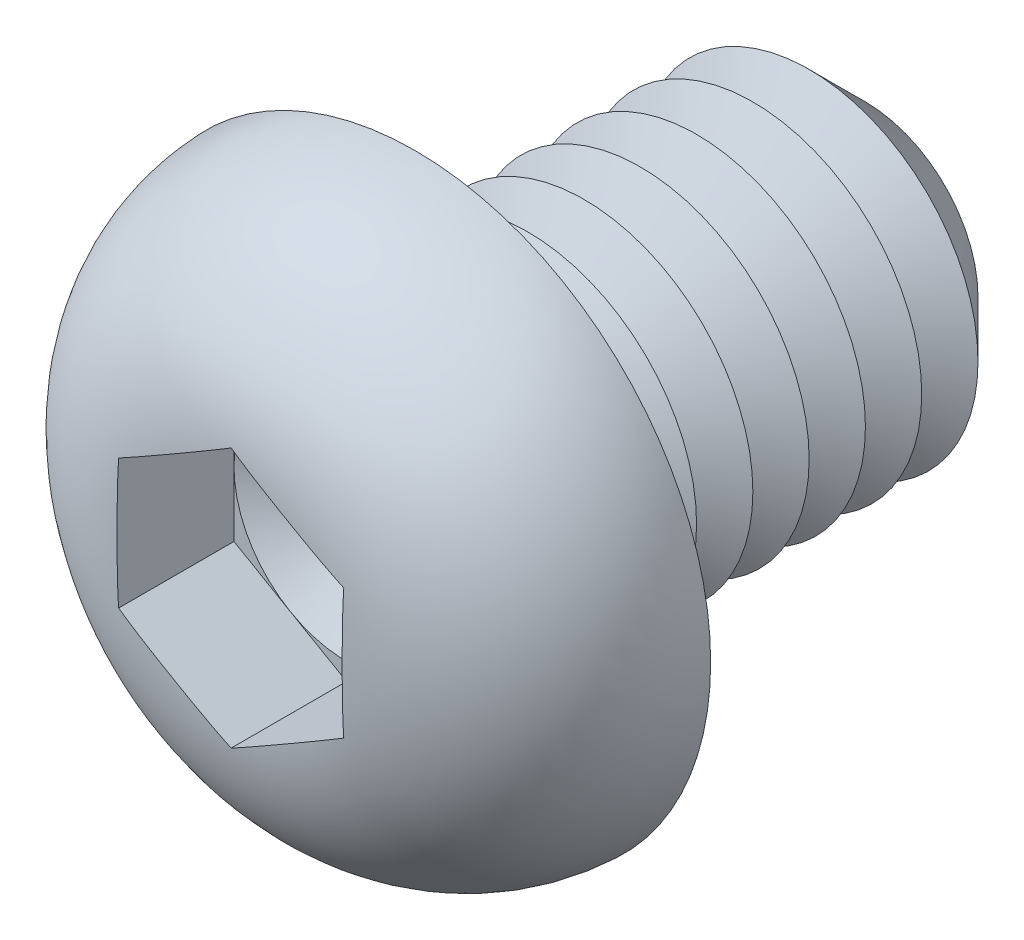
ISO-10303-21;
HEADER;
FILE_DESCRIPTION(('STEP AP214'),'2;1');
FILE_NAME('part.step','',(''),(''),'','','');
FILE_SCHEMA(('AUTOMOTIVE_DESIGN { 1 0 10303 214 1 1 1 1 }'));
ENDSEC;
DATA;
#1=APPLICATION_CONTEXT('core data for automotive mechanical design processes');
#2=APPLICATION_PROTOCOL_DEFINITION('international standard','automotive_design',2000,#1);
#3=PRODUCT_CONTEXT('',#1,'mechanical');
#4=PRODUCT('Part','Part','',(#3));
#5=PRODUCT_RELATED_PRODUCT_CATEGORY('part','',(#4));
#6=PRODUCT_DEFINITION_FORMATION('','',#4);
#7=PRODUCT_DEFINITION_CONTEXT('part definition',#1,'design');
#8=PRODUCT_DEFINITION('design','',#6,#7);
#9=PRODUCT_DEFINITION_SHAPE('','',#8);
#10=(LENGTH_UNIT() NAMED_UNIT(*) SI_UNIT(.MILLI.,.METRE.));
#11=(NAMED_UNIT(*) PLANE_ANGLE_UNIT() SI_UNIT($,.RADIAN.));
#12=(NAMED_UNIT(*) SI_UNIT($,.STERADIAN.) SOLID_ANGLE_UNIT());
#13=UNCERTAINTY_MEASURE_WITH_UNIT(LENGTH_MEASURE(1.E-05),#10,'distance_accuracy_value','');
#14=(GEOMETRIC_REPRESENTATION_CONTEXT(3) GLOBAL_UNCERTAINTY_ASSIGNED_CONTEXT((#13)) GLOBAL_UNIT_ASSIGNED_CONTEXT((#10,
#11,#12)) REPRESENTATION_CONTEXT('',''));
#15=CARTESIAN_POINT('',(0.,0.,0.));
#16=DIRECTION('',(0.,0.,1.));
#17=DIRECTION('',(1.,0.,0.));
#18=AXIS2_PLACEMENT_3D('',#15,#16,#17);
#19=CARTESIAN_POINT('',(0.,0.,1.22));
#20=DIRECTION('',(0.,0.,1.));
#21=DIRECTION('',(1.,0.,0.));
#22=AXIS2_PLACEMENT_3D('',#19,#20,#21);
#23=PLANE('',#22);
#24=CARTESIAN_POINT('',(0.,0.,1.22));
#25=DIRECTION('',(0.,0.,1.));
#26=DIRECTION('',(1.,0.,0.));
#27=AXIS2_PLACEMENT_3D('',#24,#25,#26);
#28=CIRCLE('',#27,2.);
#29=CARTESIAN_POINT('',(2.,0.,1.22));
#30=VERTEX_POINT('',#29);
#31=CARTESIAN_POINT('',(1.,1.73205080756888,1.22));
#32=VERTEX_POINT('',#31);
#33=EDGE_CURVE('E117',#30,#32,#28,.T.);
#34=ORIENTED_EDGE('',*,*,#33,.F.);
#35=DIRECTION('',(0.,1.,0.));
#36=VECTOR('',#35,1.);
#37=CARTESIAN_POINT('',(2.,-1.15470053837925,1.22));
#38=LINE('',#37,#36);
#39=CARTESIAN_POINT('',(2.,1.15470053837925,1.22));
#40=VERTEX_POINT('',#39);
#41=EDGE_CURVE('E140',#30,#40,#38,.T.);
#42=ORIENTED_EDGE('',*,*,#41,.T.);
#43=DIRECTION('',(-0.866025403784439,0.5,0.));
#44=VECTOR('',#43,1.);
#45=CARTESIAN_POINT('',(2.,1.15470053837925,1.22));
#46=LINE('',#45,#44);
#47=EDGE_CURVE('E136',#40,#32,#46,.T.);
#48=ORIENTED_EDGE('',*,*,#47,.T.);
#49=EDGE_LOOP('',(#34,#42,#48));
#50=FACE_BOUND('',#49,.T.);
#51=ADVANCED_FACE('F39',(#50),#23,.T.);
#52=CARTESIAN_POINT('',(0.,0.,1.22));
#53=DIRECTION('',(0.,0.,1.));
#54=DIRECTION('',(1.,0.,0.));
#55=AXIS2_PLACEMENT_3D('',#52,#53,#54);
#56=CIRCLE('',#55,2.);
#57=CARTESIAN_POINT('',(-1.,1.73205080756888,1.22));
#58=VERTEX_POINT('',#57);
#59=EDGE_CURVE('E11',#32,#58,#56,.T.);
#60=ORIENTED_EDGE('',*,*,#59,.F.);
#61=CARTESIAN_POINT('',(0.,2.3094010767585,1.22));
#62=VERTEX_POINT('',#61);
#63=EDGE_CURVE('E130',#32,#62,#46,.T.);
#64=ORIENTED_EDGE('',*,*,#63,.T.);
#65=DIRECTION('',(-0.866025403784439,-0.5,0.));
#66=VECTOR('',#65,1.);
#67=CARTESIAN_POINT('',(0.,2.3094010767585,1.22));
#68=LINE('',#67,#66);
#69=EDGE_CURVE('E131',#62,#58,#68,.T.);
#70=ORIENTED_EDGE('',*,*,#69,.T.);
#71=EDGE_LOOP('',(#60,#64,#70));
#72=FACE_BOUND('',#71,.T.);
#73=ADVANCED_FACE('F129',(#72),#23,.T.);
#74=CARTESIAN_POINT('',(-2.,0.,1.22));
#75=VERTEX_POINT('',#74);
#76=EDGE_CURVE('E49',#58,#75,#56,.T.);
#77=ORIENTED_EDGE('',*,*,#76,.F.);
#78=CARTESIAN_POINT('',(-2.,1.15470053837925,1.22));
#79=VERTEX_POINT('',#78);
#80=EDGE_CURVE('E143',#58,#79,#68,.T.);
#81=ORIENTED_EDGE('',*,*,#80,.T.);
#82=DIRECTION('',(0.,-1.,0.));
#83=VECTOR('',#82,1.);
#84=CARTESIAN_POINT('',(-2.,1.15470053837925,1.22));
#85=LINE('',#84,#83);
#86=EDGE_CURVE('E153',#79,#75,#85,.T.);
#87=ORIENTED_EDGE('',*,*,#86,.T.);
#88=EDGE_LOOP('',(#77,#81,#87));
#89=FACE_BOUND('',#88,.T.);
#90=ADVANCED_FACE('F267',(#89),#23,.T.);
#91=CARTESIAN_POINT('',(-1.,-1.73205080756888,1.22));
#92=VERTEX_POINT('',#91);
#93=EDGE_CURVE('E253',#75,#92,#56,.T.);
#94=ORIENTED_EDGE('',*,*,#93,.F.);
#95=CARTESIAN_POINT('',(-2.,-1.15470053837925,1.22));
#96=VERTEX_POINT('',#95);
#97=EDGE_CURVE('E152',#75,#96,#85,.T.);
#98=ORIENTED_EDGE('',*,*,#97,.T.);
#99=DIRECTION('',(0.866025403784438,-0.5,0.));
#100=VECTOR('',#99,1.);
#101=CARTESIAN_POINT('',(-2.,-1.15470053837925,1.22));
#102=LINE('',#101,#100);
#103=EDGE_CURVE('E158',#96,#92,#102,.T.);
#104=ORIENTED_EDGE('',*,*,#103,.T.);
#105=EDGE_LOOP('',(#94,#98,#104));
#106=FACE_BOUND('',#105,.T.);
#107=ADVANCED_FACE('F261',(#106),#23,.T.);
#108=CARTESIAN_POINT('',(0.999999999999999,-1.73205080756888,1.22));
#109=VERTEX_POINT('',#108);
#110=EDGE_CURVE('E56',#92,#109,#56,.T.);
#111=ORIENTED_EDGE('',*,*,#110,.F.);
#112=CARTESIAN_POINT('',(0.,-2.3094010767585,1.22));
#113=VERTEX_POINT('',#112);
#114=EDGE_CURVE('E157',#92,#113,#102,.T.);
#115=ORIENTED_EDGE('',*,*,#114,.T.);
#116=DIRECTION('',(0.866025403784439,0.5,0.));
#117=VECTOR('',#116,1.);
#118=CARTESIAN_POINT('',(0.,-2.3094010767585,1.22));
#119=LINE('',#118,#117);
#120=EDGE_CURVE('E163',#113,#109,#119,.T.);
#121=ORIENTED_EDGE('',*,*,#120,.T.);
#122=EDGE_LOOP('',(#111,#115,#121));
#123=FACE_BOUND('',#122,.T.);
#124=ADVANCED_FACE('F303',(#123),#23,.T.);
#125=CARTESIAN_POINT('',(0.,0.,-8.));
#126=DIRECTION('',(0.,0.,1.));
#127=DIRECTION('',(1.,0.,0.));
#128=AXIS2_PLACEMENT_3D('',#125,#126,#127);
#129=CYLINDRICAL_SURFACE('',#128,3.);
#130=CARTESIAN_POINT('',(0.,0.,-0.5));
#131=DIRECTION('',(0.,0.,1.));
#132=DIRECTION('',(1.,0.,0.));
#133=AXIS2_PLACEMENT_3D('',#130,#131,#132);
#134=CIRCLE('',#133,3.);
#135=CARTESIAN_POINT('',(3.,0.,-0.5));
#136=VERTEX_POINT('',#135);
#137=EDGE_CURVE('E241',#136,#136,#134,.F.);
#138=ORIENTED_EDGE('',*,*,#137,.T.);
#139=EDGE_LOOP('',(#138));
#140=FACE_BOUND('',#139,.T.);
#141=CARTESIAN_POINT('',(0.,0.,-1.));
#142=DIRECTION('',(0.,0.,1.));
#143=DIRECTION('',(1.,0.,0.));
#144=AXIS2_PLACEMENT_3D('',#141,#142,#143);
#145=CIRCLE('',#144,3.00000000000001);
#146=CARTESIAN_POINT('',(3.00000000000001,0.,-1.));
#147=VERTEX_POINT('',#146);
#148=EDGE_CURVE('E138',#147,#147,#145,.T.);
#149=ORIENTED_EDGE('',*,*,#148,.T.);
#150=EDGE_LOOP('',(#149));
#151=FACE_BOUND('',#150,.T.);
#152=ADVANCED_FACE('F304',(#140,#151),#129,.T.);
#153=CARTESIAN_POINT('',(0.,5.25,0.));
#154=DIRECTION('',(0.,0.,1.));
#155=DIRECTION('',(1.,0.,0.));
#156=AXIS2_PLACEMENT_3D('',#153,#154,#155);
#157=PLANE('',#156);
#158=CARTESIAN_POINT('',(0.,0.,0.));
#159=DIRECTION('',(0.,0.,1.));
#160=DIRECTION('',(1.,0.,0.));
#161=AXIS2_PLACEMENT_3D('',#158,#159,#160);
#162=CIRCLE('',#161,3.5);
#163=CARTESIAN_POINT('',(3.5,0.,0.));
#164=VERTEX_POINT('',#163);
#165=EDGE_CURVE('E244',#164,#164,#162,.T.);
#166=ORIENTED_EDGE('',*,*,#165,.T.);
#167=EDGE_LOOP('',(#166));
#168=FACE_BOUND('',#167,.T.);
#169=CARTESIAN_POINT('',(0.,0.,0.));
#170=DIRECTION('',(0.,0.,1.));
#171=DIRECTION('',(1.,0.,0.));
#172=AXIS2_PLACEMENT_3D('',#169,#170,#171);
#173=CIRCLE('',#172,5.25);
#174=CARTESIAN_POINT('',(5.25,0.,0.));
#175=VERTEX_POINT('',#174);
#176=EDGE_CURVE('E174',#175,#175,#173,.T.);
#177=ORIENTED_EDGE('',*,*,#176,.F.);
#178=EDGE_LOOP('',(#177));
#179=FACE_BOUND('',#178,.T.);
#180=ADVANCED_FACE('F307',(#168,#179),#157,.F.);
#181=CARTESIAN_POINT('',(0.,0.,-0.0999999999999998));
#182=DIRECTION('',(0.,0.,1.));
#183=DIRECTION('',(1.,0.,0.));
#184=AXIS2_PLACEMENT_3D('',#181,#182,#183);
#185=DEGENERATE_TOROIDAL_SURFACE('',#184,1.85147090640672,3.4,.T.);
#186=CARTESIAN_POINT('',(-2.0002,1.15458506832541,3.26900492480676));
#187=CARTESIAN_POINT('',(-1.91694658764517,1.20265144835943,3.27552708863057));
#188=CARTESIAN_POINT('',(-1.83362001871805,1.25076006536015,3.28041849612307));
#189=CARTESIAN_POINT('',(-1.66691146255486,1.34700929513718,3.28784569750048));
#190=CARTESIAN_POINT('',(-1.58352950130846,1.39514989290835,3.29038223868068));
#191=CARTESIAN_POINT('',(-1.4167967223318,1.49141310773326,3.29400753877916));
#192=CARTESIAN_POINT('',(-1.33344591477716,1.5395357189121,3.29509714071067));
#193=CARTESIAN_POINT('',(-1.16673007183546,1.63578915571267,3.29647051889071));
#194=CARTESIAN_POINT('',(-1.08336503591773,1.68391998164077,3.29675420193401));
#195=CARTESIAN_POINT('',(-0.916634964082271,1.78018163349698,3.29675420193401));
#196=CARTESIAN_POINT('',(-0.833269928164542,1.82831245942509,3.29647051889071));
#197=CARTESIAN_POINT('',(-0.666554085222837,1.92456589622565,3.29509714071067));
#198=CARTESIAN_POINT('',(-0.583203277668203,1.9726885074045,3.29400753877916));
#199=CARTESIAN_POINT('',(-0.416470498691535,2.06895172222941,3.29038223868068));
#200=CARTESIAN_POINT('',(-0.333088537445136,2.11709232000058,3.28784569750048));
#201=CARTESIAN_POINT('',(-0.166379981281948,2.21334154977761,3.28041849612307));
#202=CARTESIAN_POINT('',(-0.0830534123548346,2.26145016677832,3.27552708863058));
#203=CARTESIAN_POINT('',(0.000200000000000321,2.30951654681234,3.26900492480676));
#204=B_SPLINE_CURVE_WITH_KNOTS('',3,(#186,#187,#188,#189,#190,#191,#192,#193,#194,#195,#196,
#197,#198,#199,#200,#201,#202,#203),.UNSPECIFIED.,.F.,.F.,(4,2,2,2,2,2,2,2,4),(0.,
0.289010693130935,0.57792963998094,0.866680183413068,1.15546411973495,1.44424805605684,
1.73299859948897,2.02191754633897,2.31092823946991),.UNSPECIFIED.);
#205=CARTESIAN_POINT('',(-2.,1.15470053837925,3.26902062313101));
#206=VERTEX_POINT('',#205);
#207=CARTESIAN_POINT('',(1.70733705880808E-11,2.30940107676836,3.2690206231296));
#208=VERTEX_POINT('',#207);
#209=EDGE_CURVE('E195',#206,#208,#204,.T.);
#210=ORIENTED_EDGE('',*,*,#209,.T.);
#211=CARTESIAN_POINT('',(-0.000199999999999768,2.30951654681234,3.26900492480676));
#212=CARTESIAN_POINT('',(0.0830534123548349,2.26145016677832,3.27552708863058));
#213=CARTESIAN_POINT('',(0.166379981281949,2.21334154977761,3.28041849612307));
#214=CARTESIAN_POINT('',(0.333088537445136,2.11709232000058,3.28784569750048));
#215=CARTESIAN_POINT('',(0.416470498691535,2.06895172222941,3.29038223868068));
#216=CARTESIAN_POINT('',(0.583203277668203,1.9726885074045,3.29400753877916));
#217=CARTESIAN_POINT('',(0.666554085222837,1.92456589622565,3.29509714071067));
#218=CARTESIAN_POINT('',(0.833269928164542,1.82831245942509,3.29647051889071));
#219=CARTESIAN_POINT('',(0.916634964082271,1.78018163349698,3.29675420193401));
#220=CARTESIAN_POINT('',(1.08336503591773,1.68391998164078,3.29675420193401));
#221=CARTESIAN_POINT('',(1.16673007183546,1.63578915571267,3.29647051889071));
#222=CARTESIAN_POINT('',(1.33344591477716,1.5395357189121,3.29509714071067));
#223=CARTESIAN_POINT('',(1.4167967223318,1.49141310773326,3.29400753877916));
#224=CARTESIAN_POINT('',(1.58352950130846,1.39514989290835,3.29038223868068));
#225=CARTESIAN_POINT('',(1.66691146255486,1.34700929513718,3.28784569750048));
#226=CARTESIAN_POINT('',(1.83362001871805,1.25076006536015,3.28041849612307));
#227=CARTESIAN_POINT('',(1.91694658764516,1.20265144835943,3.27552708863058));
#228=CARTESIAN_POINT('',(2.0002,1.15458506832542,3.26900492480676));
#229=B_SPLINE_CURVE_WITH_KNOTS('',3,(#211,#212,#213,#214,#215,#216,#217,#218,#219,#220,#221,
#222,#223,#224,#225,#226,#227,#228),.UNSPECIFIED.,.F.,.F.,(4,2,2,2,2,2,2,2,4),(0.,
0.289010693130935,0.577929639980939,0.866680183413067,1.15546411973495,1.44424805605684,
1.73299859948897,2.02191754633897,2.31092823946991),.UNSPECIFIED.);
#230=CARTESIAN_POINT('',(2.,1.15470053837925,3.26902062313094));
#231=VERTEX_POINT('',#230);
#232=EDGE_CURVE('E224',#208,#231,#229,.T.);
#233=ORIENTED_EDGE('',*,*,#232,.T.);
#234=CARTESIAN_POINT('',(2.,0.,3.29675420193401));
#235=CARTESIAN_POINT('',(2.,-0.0838690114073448,3.29675159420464));
#236=CARTESIAN_POINT('',(2.,-0.167737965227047,3.29653427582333));
#237=CARTESIAN_POINT('',(2.,-0.335473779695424,3.29552217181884));
#238=CARTESIAN_POINT('',(2.,-0.419340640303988,3.29472737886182));
#239=CARTESIAN_POINT('',(2.,-0.587092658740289,3.29218243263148));
#240=CARTESIAN_POINT('',(2.,-0.670977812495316,3.29043194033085));
#241=CARTESIAN_POINT('',(2.,-0.838702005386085,3.28542814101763));
#242=CARTESIAN_POINT('',(2.,-0.922541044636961,3.28217483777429));
#243=CARTESIAN_POINT('',(2.,-1.173343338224,3.26923984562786));
#244=CARTESIAN_POINT('',(2.,-1.34017699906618,3.25638268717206));
#245=CARTESIAN_POINT('',(2.,-1.67225876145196,3.21731215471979));
#246=CARTESIAN_POINT('',(2.,-1.83750825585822,3.19111187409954));
#247=CARTESIAN_POINT('',(2.,-2.10571503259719,3.13417573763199));
#248=CARTESIAN_POINT('',(2.,-2.20973442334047,3.10844622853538));
#249=CARTESIAN_POINT('',(2.,-2.41562153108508,3.04936015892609));
#250=CARTESIAN_POINT('',(2.,-2.51748898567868,3.01600267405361));
#251=CARTESIAN_POINT('',(2.,-2.71832295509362,2.94120377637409));
#252=CARTESIAN_POINT('',(2.,-2.81728700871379,2.89975572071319));
#253=CARTESIAN_POINT('',(2.,-3.01134256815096,2.80859624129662));
#254=CARTESIAN_POINT('',(2.,-3.10643425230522,2.75888519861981));
#255=CARTESIAN_POINT('',(2.,-3.29253530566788,2.65079509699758));
#256=CARTESIAN_POINT('',(2.,-3.38350832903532,2.59235327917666));
#257=CARTESIAN_POINT('',(2.,-3.55964478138,2.46728791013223));
#258=CARTESIAN_POINT('',(2.,-3.64480873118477,2.40066509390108));
#259=CARTESIAN_POINT('',(2.,-3.80840353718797,2.25961603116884));
#260=CARTESIAN_POINT('',(2.,-3.88683504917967,2.18519054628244));
#261=CARTESIAN_POINT('',(2.,-4.03608847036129,2.02906828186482));
#262=CARTESIAN_POINT('',(2.,-4.106911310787,1.94737239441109));
#263=CARTESIAN_POINT('',(2.,-4.23287471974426,1.78665318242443));
#264=CARTESIAN_POINT('',(2.,-4.2888832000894,1.7083085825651));
#265=CARTESIAN_POINT('',(2.,-4.39372062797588,1.54691061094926));
#266=CARTESIAN_POINT('',(2.,-4.44254705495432,1.46385560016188));
#267=CARTESIAN_POINT('',(2.,-4.53249771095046,1.29375158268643));
#268=CARTESIAN_POINT('',(2.,-4.57362814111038,1.20670586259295));
#269=CARTESIAN_POINT('',(2.,-4.6478549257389,1.02924414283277));
#270=CARTESIAN_POINT('',(2.,-4.68094842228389,0.938826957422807));
#271=CARTESIAN_POINT('',(2.,-4.76413649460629,0.674747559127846));
#272=CARTESIAN_POINT('',(2.,-4.80368573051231,0.497625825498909));
#273=CARTESIAN_POINT('',(2.,-4.85179982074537,0.13932226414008));
#274=CARTESIAN_POINT('',(2.,-4.86036774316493,-0.0418591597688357));
#275=CARTESIAN_POINT('',(2.,-4.84642577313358,-0.399473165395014));
#276=CARTESIAN_POINT('',(2.,-4.82452156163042,-0.575929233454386));
#277=CARTESIAN_POINT('',(2.,-4.75142809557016,-0.922615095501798));
#278=CARTESIAN_POINT('',(2.,-4.70024536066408,-1.09284626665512));
#279=CARTESIAN_POINT('',(2.,-4.57020203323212,-1.42258491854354));
#280=CARTESIAN_POINT('',(2.,-4.49131097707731,-1.58208036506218));
#281=CARTESIAN_POINT('',(2.,-4.3083542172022,-1.8860021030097));
#282=CARTESIAN_POINT('',(2.,-4.2042742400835,-2.03041978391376));
#283=CARTESIAN_POINT('',(2.,-3.97174533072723,-2.30354399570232));
#284=CARTESIAN_POINT('',(2.,-3.84281347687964,-2.43183812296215));
#285=CARTESIAN_POINT('',(2.,-3.56631740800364,-2.66612298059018));
#286=CARTESIAN_POINT('',(2.,-3.41877418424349,-2.77213848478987));
#287=CARTESIAN_POINT('',(2.,-3.18261597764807,-2.91604941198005));
#288=CARTESIAN_POINT('',(2.,-3.09905663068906,-2.96247915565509));
#289=CARTESIAN_POINT('',(2.,-2.92856838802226,-3.04879370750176));
#290=CARTESIAN_POINT('',(2.,-2.84163827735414,-3.08867612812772));
#291=CARTESIAN_POINT('',(2.,-2.66495003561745,-3.16199567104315));
#292=CARTESIAN_POINT('',(2.,-2.57518752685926,-3.19542218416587));
#293=CARTESIAN_POINT('',(2.,-2.3936698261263,-3.25594506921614));
#294=CARTESIAN_POINT('',(2.,-2.30191676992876,-3.28304789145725));
#295=CARTESIAN_POINT('',(2.,-2.07265810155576,-3.34285611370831));
#296=CARTESIAN_POINT('',(2.,-1.93423373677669,-3.37205334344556));
#297=CARTESIAN_POINT('',(2.,-1.65546420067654,-3.419280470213));
#298=CARTESIAN_POINT('',(2.,-1.51511762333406,-3.43730169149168));
#299=CARTESIAN_POINT('',(2.,-1.23291689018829,-3.46473877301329));
#300=CARTESIAN_POINT('',(2.,-1.09105869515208,-3.47411015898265));
#301=CARTESIAN_POINT('',(2.,-0.807138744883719,-3.48717303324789));
#302=CARTESIAN_POINT('',(2.,-0.665077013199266,-3.4908651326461));
#303=CARTESIAN_POINT('',(2.,-0.451303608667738,-3.49429675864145));
#304=CARTESIAN_POINT('',(2.,-0.379602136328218,-3.49508825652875));
#305=CARTESIAN_POINT('',(2.,-0.236195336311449,-3.49619580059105));
#306=CARTESIAN_POINT('',(2.,-0.164490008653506,-3.49651184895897));
#307=CARTESIAN_POINT('',(2.,-0.0210718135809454,-3.49680708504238));
#308=CARTESIAN_POINT('',(2.,0.0506410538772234,-3.49678623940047));
#309=CARTESIAN_POINT('',(2.,0.194065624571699,-3.49639104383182));
#310=CARTESIAN_POINT('',(2.,0.265777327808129,-3.49601669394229));
#311=CARTESIAN_POINT('',(2.,0.480501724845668,-3.4941697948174));
#312=CARTESIAN_POINT('',(2.,0.623510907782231,-3.49197539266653));
#313=CARTESIAN_POINT('',(2.,0.909378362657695,-3.48318258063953));
#314=CARTESIAN_POINT('',(2.,1.05223667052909,-3.47658576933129));
#315=CARTESIAN_POINT('',(2.,1.30726724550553,-3.45800282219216));
#316=CARTESIAN_POINT('',(2.,1.41953767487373,-3.44745204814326));
#317=CARTESIAN_POINT('',(2.,1.64336701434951,-3.42020385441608));
#318=CARTESIAN_POINT('',(2.,1.75492585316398,-3.40350582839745));
#319=CARTESIAN_POINT('',(2.,1.97590795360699,-3.36293007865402));
#320=CARTESIAN_POINT('',(2.,2.08534088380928,-3.33910600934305));
#321=CARTESIAN_POINT('',(2.,2.30216001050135,-3.28336687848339));
#322=CARTESIAN_POINT('',(2.,2.40954602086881,-3.25145108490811));
#323=CARTESIAN_POINT('',(2.,2.62289868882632,-3.1784271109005));
#324=CARTESIAN_POINT('',(2.,2.72882262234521,-3.13719314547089));
#325=CARTESIAN_POINT('',(2.,2.93660837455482,-3.04548652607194));
#326=CARTESIAN_POINT('',(2.,3.03847031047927,-2.99501413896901));
#327=CARTESIAN_POINT('',(2.,3.23738754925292,-2.88459171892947));
#328=CARTESIAN_POINT('',(2.,3.33442546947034,-2.82461027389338));
#329=CARTESIAN_POINT('',(2.,3.52225616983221,-2.69545434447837));
#330=CARTESIAN_POINT('',(2.,3.61304636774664,-2.62627609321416));
#331=CARTESIAN_POINT('',(2.,3.77958578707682,-2.48563135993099));
#332=CARTESIAN_POINT('',(2.,3.85595570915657,-2.41489922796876));
#333=CARTESIAN_POINT('',(2.,4.00175744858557,-2.26661746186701));
#334=CARTESIAN_POINT('',(2.,4.07118992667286,-2.18906847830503));
#335=CARTESIAN_POINT('',(2.,4.20228235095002,-2.02784942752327));
#336=CARTESIAN_POINT('',(2.,4.26395450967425,-1.94418931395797));
#337=CARTESIAN_POINT('',(2.,4.37897455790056,-1.7713710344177));
#338=CARTESIAN_POINT('',(2.,4.43232318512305,-1.68221335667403));
#339=CARTESIAN_POINT('',(2.,4.5685109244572,-1.42722170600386));
#340=CARTESIAN_POINT('',(2.,4.64167742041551,-1.25607726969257));
#341=CARTESIAN_POINT('',(2.,4.75695354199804,-0.903699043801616));
#342=CARTESIAN_POINT('',(2.,4.79906366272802,-0.722465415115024));
#343=CARTESIAN_POINT('',(2.,4.84982785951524,-0.362243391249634));
#344=CARTESIAN_POINT('',(2.,4.85966759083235,-0.183422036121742));
#345=CARTESIAN_POINT('',(2.,4.84889099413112,0.17327689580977));
#346=CARTESIAN_POINT('',(2.,4.82827907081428,0.351154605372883));
#347=CARTESIAN_POINT('',(2.,4.75760776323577,0.699332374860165));
#348=CARTESIAN_POINT('',(2.,4.70780624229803,0.869684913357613));
#349=CARTESIAN_POINT('',(2.,4.58058971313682,1.199716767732));
#350=CARTESIAN_POINT('',(2.,4.50317623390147,1.35939667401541));
#351=CARTESIAN_POINT('',(2.,4.32230037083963,1.66542907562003));
#352=CARTESIAN_POINT('',(2.,4.21858077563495,1.81162931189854));
#353=CARTESIAN_POINT('',(2.,3.98879583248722,2.08527000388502));
#354=CARTESIAN_POINT('',(2.,3.86272429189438,2.21270524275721));
#355=CARTESIAN_POINT('',(2.,3.58743550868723,2.45020985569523));
#356=CARTESIAN_POINT('',(2.,3.43756474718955,2.55951924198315));
#357=CARTESIAN_POINT('',(2.,3.12282273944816,2.7535430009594));
#358=CARTESIAN_POINT('',(2.,2.95795742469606,2.83826704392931));
#359=CARTESIAN_POINT('',(2.,2.67096435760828,2.96064273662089));
#360=CARTESIAN_POINT('',(2.,2.55150855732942,3.00473766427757));
#361=CARTESIAN_POINT('',(2.,2.30905936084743,3.08191633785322));
#362=CARTESIAN_POINT('',(2.,2.18606487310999,3.11499664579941));
#363=CARTESIAN_POINT('',(2.,1.93761764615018,3.17114962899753));
#364=CARTESIAN_POINT('',(2.,1.8121607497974,3.19420352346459));
#365=CARTESIAN_POINT('',(2.,1.56000755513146,3.23170431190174));
#366=CARTESIAN_POINT('',(2.,1.43331126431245,3.24615125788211));
#367=CARTESIAN_POINT('',(2.,1.19785080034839,3.26676473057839));
#368=CARTESIAN_POINT('',(2.,1.08915974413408,3.27383022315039));
#369=CARTESIAN_POINT('',(2.,0.87159878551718,3.28448481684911));
#370=CARTESIAN_POINT('',(2.,0.762728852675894,3.28807324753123));
#371=CARTESIAN_POINT('',(2.,0.54488171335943,3.29312180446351));
#372=CARTESIAN_POINT('',(2.,0.435904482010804,3.29458062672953));
#373=CARTESIAN_POINT('',(2.,0.217951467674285,3.29639847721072));
#374=CARTESIAN_POINT('',(2.,0.108975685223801,3.29675759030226));
#375=CARTESIAN_POINT('',(2.,0.,3.29675420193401));
#376=B_SPLINE_CURVE_WITH_KNOTS('',3,(#234,#235,#236,#237,#238,#239,#240,#241,#242,#243,#244,
#245,#246,#247,#248,#249,#250,#251,#252,#253,#254,#255,#256,#257,#258,#259,#260,#261,#262,#263,
#264,#265,#266,#267,#268,#269,#270,#271,#272,#273,#274,#275,#276,#277,#278,#279,#280,#281,#282,
#283,#284,#285,#286,#287,#288,#289,#290,#291,#292,#293,#294,#295,#296,#297,#298,#299,#300,#301,
#302,#303,#304,#305,#306,#307,#308,#309,#310,#311,#312,#313,#314,#315,#316,#317,#318,#319,#320,
#321,#322,#323,#324,#325,#326,#327,#328,#329,#330,#331,#332,#333,#334,#335,#336,#337,#338,#339,
#340,#341,#342,#343,#344,#345,#346,#347,#348,#349,#350,#351,#352,#353,#354,#355,#356,#357,#358,
#359,#360,#361,#362,#363,#364,#365,#366,#367,#368,#369,#370,#371,#372,#373,#374,#375),
.UNSPECIFIED.,.T.,.F.,(4,2,2,2,2,2,2,2,2,2,2,2,2,2,2,2,2,2,2,2,2,2,2,2,2,2,2,2,2,2,2,2,2,2,2,2,
2,2,2,2,2,2,2,2,2,2,2,2,2,2,2,2,2,2,2,2,2,2,2,2,2,2,2,2,2,2,2,2,2,2,4),(0.,0.251606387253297,
0.503215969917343,0.754914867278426,1.00661313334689,1.50825543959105,2.00940643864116,
2.33061510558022,2.65186271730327,2.97337521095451,3.29487288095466,3.61880390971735,
3.94270585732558,4.26657621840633,4.59040689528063,4.8789527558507,5.16759964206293,
5.45601293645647,5.74452864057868,6.28608750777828,6.82759274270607,7.35848716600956,
7.8892634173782,8.42062506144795,8.95228851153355,9.49557283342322,10.0382497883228,
10.3247866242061,10.6114277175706,10.8985359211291,11.1853499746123,11.6091713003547,
12.0333212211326,12.4596400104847,12.8859129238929,13.1010304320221,13.316146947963,
13.5312847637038,13.746422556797,14.1754765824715,14.6043748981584,14.9425387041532,
15.2807358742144,15.6164481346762,15.9521907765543,16.2927694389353,16.6333382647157,
16.9750565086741,17.3169151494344,17.6287548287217,17.9405647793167,18.2518777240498,
18.5631630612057,19.1185081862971,19.6738444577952,20.20853386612,20.7431459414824,
21.2731049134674,21.8030345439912,22.3383600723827,22.8738341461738,23.4279697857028,
23.9818871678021,24.3633752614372,24.7449823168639,25.1273011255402,25.5096176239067,
25.8363061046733,26.163057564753,26.4900090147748,26.8169352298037),.UNSPECIFIED.);
#377=CARTESIAN_POINT('',(2.,-1.15470053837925,3.26902062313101));
#378=VERTEX_POINT('',#377);
#379=EDGE_CURVE('E233',#231,#378,#376,.T.);
#380=ORIENTED_EDGE('',*,*,#379,.T.);
#381=CARTESIAN_POINT('',(2.0002,-1.15458506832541,3.26900492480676));
#382=CARTESIAN_POINT('',(1.91694658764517,-1.20265144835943,3.27552708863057));
#383=CARTESIAN_POINT('',(1.83362001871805,-1.25076006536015,3.28041849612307));
#384=CARTESIAN_POINT('',(1.66691146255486,-1.34700929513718,3.28784569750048));
#385=CARTESIAN_POINT('',(1.58352950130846,-1.39514989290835,3.29038223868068));
#386=CARTESIAN_POINT('',(1.4167967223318,-1.49141310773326,3.29400753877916));
#387=CARTESIAN_POINT('',(1.33344591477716,-1.5395357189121,3.29509714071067));
#388=CARTESIAN_POINT('',(1.16673007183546,-1.63578915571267,3.29647051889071));
#389=CARTESIAN_POINT('',(1.08336503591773,-1.68391998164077,3.29675420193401));
#390=CARTESIAN_POINT('',(0.916634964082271,-1.78018163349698,3.29675420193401));
#391=CARTESIAN_POINT('',(0.833269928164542,-1.82831245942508,3.29647051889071));
#392=CARTESIAN_POINT('',(0.666554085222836,-1.92456589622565,3.29509714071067));
#393=CARTESIAN_POINT('',(0.583203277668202,-1.97268850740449,3.29400753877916));
#394=CARTESIAN_POINT('',(0.416470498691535,-2.06895172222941,3.29038223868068));
#395=CARTESIAN_POINT('',(0.333088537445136,-2.11709232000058,3.28784569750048));
#396=CARTESIAN_POINT('',(0.166379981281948,-2.2133415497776,3.28041849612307));
#397=CARTESIAN_POINT('',(0.0830534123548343,-2.26145016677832,3.27552708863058));
#398=CARTESIAN_POINT('',(-0.000200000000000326,-2.30951654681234,3.26900492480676));
#399=B_SPLINE_CURVE_WITH_KNOTS('',3,(#381,#382,#383,#384,#385,#386,#387,#388,#389,#390,#391,
#392,#393,#394,#395,#396,#397,#398),.UNSPECIFIED.,.F.,.F.,(4,2,2,2,2,2,2,2,4),(0.,
0.289010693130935,0.57792963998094,0.866680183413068,1.15546411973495,1.44424805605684,
1.73299859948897,2.02191754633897,2.31092823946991),.UNSPECIFIED.);
#400=CARTESIAN_POINT('',(0.,-2.3094010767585,3.26902062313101));
#401=VERTEX_POINT('',#400);
#402=EDGE_CURVE('E277',#378,#401,#399,.T.);
#403=ORIENTED_EDGE('',*,*,#402,.T.);
#404=CARTESIAN_POINT('',(0.000199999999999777,-2.30951654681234,3.26900492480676));
#405=CARTESIAN_POINT('',(-0.083053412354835,-2.26145016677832,3.27552708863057));
#406=CARTESIAN_POINT('',(-0.166379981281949,-2.21334154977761,3.28041849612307));
#407=CARTESIAN_POINT('',(-0.333088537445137,-2.11709232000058,3.28784569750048));
#408=CARTESIAN_POINT('',(-0.416470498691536,-2.06895172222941,3.29038223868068));
#409=CARTESIAN_POINT('',(-0.583203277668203,-1.97268850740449,3.29400753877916));
#410=CARTESIAN_POINT('',(-0.666554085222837,-1.92456589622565,3.29509714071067));
#411=CARTESIAN_POINT('',(-0.833269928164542,-1.82831245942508,3.29647051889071));
#412=CARTESIAN_POINT('',(-0.916634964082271,-1.78018163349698,3.29675420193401));
#413=CARTESIAN_POINT('',(-1.08336503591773,-1.68391998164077,3.29675420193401));
#414=CARTESIAN_POINT('',(-1.16673007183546,-1.63578915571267,3.29647051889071));
#415=CARTESIAN_POINT('',(-1.33344591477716,-1.5395357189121,3.29509714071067));
#416=CARTESIAN_POINT('',(-1.4167967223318,-1.49141310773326,3.29400753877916));
#417=CARTESIAN_POINT('',(-1.58352950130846,-1.39514989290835,3.29038223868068));
#418=CARTESIAN_POINT('',(-1.66691146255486,-1.34700929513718,3.28784569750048));
#419=CARTESIAN_POINT('',(-1.83362001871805,-1.25076006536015,3.28041849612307));
#420=CARTESIAN_POINT('',(-1.91694658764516,-1.20265144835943,3.27552708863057));
#421=CARTESIAN_POINT('',(-2.0002,-1.15458506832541,3.26900492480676));
#422=B_SPLINE_CURVE_WITH_KNOTS('',3,(#404,#405,#406,#407,#408,#409,#410,#411,#412,#413,#414,
#415,#416,#417,#418,#419,#420,#421),.UNSPECIFIED.,.F.,.F.,(4,2,2,2,2,2,2,2,4),(0.,
0.289010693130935,0.577929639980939,0.866680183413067,1.15546411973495,1.44424805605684,
1.73299859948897,2.02191754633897,2.31092823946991),.UNSPECIFIED.);
#423=CARTESIAN_POINT('',(-2.,-1.15470053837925,3.26902062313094));
#424=VERTEX_POINT('',#423);
#425=EDGE_CURVE('E274',#401,#424,#422,.T.);
#426=ORIENTED_EDGE('',*,*,#425,.T.);
#427=CARTESIAN_POINT('',(-2.,0.,3.29675420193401));
#428=CARTESIAN_POINT('',(-2.,0.0838690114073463,3.29675159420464));
#429=CARTESIAN_POINT('',(-2.,0.167737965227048,3.29653427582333));
#430=CARTESIAN_POINT('',(-2.,0.335473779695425,3.29552217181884));
#431=CARTESIAN_POINT('',(-2.,0.41934064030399,3.29472737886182));
#432=CARTESIAN_POINT('',(-2.,0.58709265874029,3.29218243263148));
#433=CARTESIAN_POINT('',(-2.,0.670977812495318,3.29043194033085));
#434=CARTESIAN_POINT('',(-2.,0.838702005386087,3.28542814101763));
#435=CARTESIAN_POINT('',(-2.,0.922541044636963,3.28217483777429));
#436=CARTESIAN_POINT('',(-2.,1.173343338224,3.26923984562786));
#437=CARTESIAN_POINT('',(-2.,1.34017699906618,3.25638268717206));
#438=CARTESIAN_POINT('',(-2.,1.67225876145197,3.21731215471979));
#439=CARTESIAN_POINT('',(-2.,1.83750825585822,3.19111187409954));
#440=CARTESIAN_POINT('',(-2.,2.10571503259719,3.13417573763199));
#441=CARTESIAN_POINT('',(-2.,2.20973442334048,3.10844622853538));
#442=CARTESIAN_POINT('',(-2.,2.41562153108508,3.04936015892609));
#443=CARTESIAN_POINT('',(-2.,2.51748898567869,3.01600267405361));
#444=CARTESIAN_POINT('',(-2.,2.71832295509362,2.94120377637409));
#445=CARTESIAN_POINT('',(-2.,2.81728700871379,2.89975572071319));
#446=CARTESIAN_POINT('',(-2.,3.01134256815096,2.80859624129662));
#447=CARTESIAN_POINT('',(-2.,3.10643425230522,2.75888519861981));
#448=CARTESIAN_POINT('',(-2.,3.29253530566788,2.65079509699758));
#449=CARTESIAN_POINT('',(-2.,3.38350832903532,2.59235327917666));
#450=CARTESIAN_POINT('',(-2.,3.55964478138,2.46728791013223));
#451=CARTESIAN_POINT('',(-2.,3.64480873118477,2.40066509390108));
#452=CARTESIAN_POINT('',(-2.,3.80840353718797,2.25961603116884));
#453=CARTESIAN_POINT('',(-2.,3.88683504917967,2.18519054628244));
#454=CARTESIAN_POINT('',(-2.,4.03608847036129,2.02906828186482));
#455=CARTESIAN_POINT('',(-2.,4.106911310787,1.94737239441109));
#456=CARTESIAN_POINT('',(-2.,4.23287471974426,1.78665318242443));
#457=CARTESIAN_POINT('',(-2.,4.2888832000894,1.7083085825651));
#458=CARTESIAN_POINT('',(-2.,4.39372062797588,1.54691061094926));
#459=CARTESIAN_POINT('',(-2.,4.44254705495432,1.46385560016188));
#460=CARTESIAN_POINT('',(-2.,4.53249771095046,1.29375158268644));
#461=CARTESIAN_POINT('',(-2.,4.57362814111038,1.20670586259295));
#462=CARTESIAN_POINT('',(-2.,4.6478549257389,1.02924414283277));
#463=CARTESIAN_POINT('',(-2.,4.68094842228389,0.938826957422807));
#464=CARTESIAN_POINT('',(-2.,4.76413649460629,0.674747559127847));
#465=CARTESIAN_POINT('',(-2.,4.80368573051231,0.497625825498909));
#466=CARTESIAN_POINT('',(-2.,4.85179982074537,0.13932226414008));
#467=CARTESIAN_POINT('',(-2.,4.86036774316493,-0.0418591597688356));
#468=CARTESIAN_POINT('',(-2.,4.84642577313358,-0.399473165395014));
#469=CARTESIAN_POINT('',(-2.,4.82452156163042,-0.575929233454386));
#470=CARTESIAN_POINT('',(-2.,4.75142809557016,-0.922615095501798));
#471=CARTESIAN_POINT('',(-2.,4.70024536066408,-1.09284626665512));
#472=CARTESIAN_POINT('',(-2.,4.57020203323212,-1.42258491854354));
#473=CARTESIAN_POINT('',(-2.,4.49131097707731,-1.58208036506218));
#474=CARTESIAN_POINT('',(-2.,4.3083542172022,-1.8860021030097));
#475=CARTESIAN_POINT('',(-2.,4.2042742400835,-2.03041978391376));
#476=CARTESIAN_POINT('',(-2.,3.97174533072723,-2.30354399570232));
#477=CARTESIAN_POINT('',(-2.,3.84281347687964,-2.43183812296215));
#478=CARTESIAN_POINT('',(-2.,3.56631740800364,-2.66612298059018));
#479=CARTESIAN_POINT('',(-2.,3.41877418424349,-2.77213848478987));
#480=CARTESIAN_POINT('',(-2.,3.18261597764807,-2.91604941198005));
#481=CARTESIAN_POINT('',(-2.,3.09905663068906,-2.96247915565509));
#482=CARTESIAN_POINT('',(-2.,2.92856838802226,-3.04879370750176));
#483=CARTESIAN_POINT('',(-2.,2.84163827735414,-3.08867612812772));
#484=CARTESIAN_POINT('',(-2.,2.66495003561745,-3.16199567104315));
#485=CARTESIAN_POINT('',(-2.,2.57518752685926,-3.19542218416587));
#486=CARTESIAN_POINT('',(-2.,2.3936698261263,-3.25594506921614));
#487=CARTESIAN_POINT('',(-2.,2.30191676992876,-3.28304789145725));
#488=CARTESIAN_POINT('',(-2.,2.07265810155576,-3.34285611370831));
#489=CARTESIAN_POINT('',(-2.,1.93423373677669,-3.37205334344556));
#490=CARTESIAN_POINT('',(-2.,1.65546420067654,-3.419280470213));
#491=CARTESIAN_POINT('',(-2.,1.51511762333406,-3.43730169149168));
#492=CARTESIAN_POINT('',(-2.,1.23291689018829,-3.46473877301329));
#493=CARTESIAN_POINT('',(-2.,1.09105869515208,-3.47411015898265));
#494=CARTESIAN_POINT('',(-2.,0.807138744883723,-3.48717303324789));
#495=CARTESIAN_POINT('',(-2.,0.66507701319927,-3.4908651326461));
#496=CARTESIAN_POINT('',(-2.,0.451303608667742,-3.49429675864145));
#497=CARTESIAN_POINT('',(-2.,0.379602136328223,-3.49508825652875));
#498=CARTESIAN_POINT('',(-2.,0.236195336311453,-3.49619580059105));
#499=CARTESIAN_POINT('',(-2.,0.16449000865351,-3.49651184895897));
#500=CARTESIAN_POINT('',(-2.,0.0210718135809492,-3.49680708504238));
#501=CARTESIAN_POINT('',(-2.,-0.0506410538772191,-3.49678623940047));
#502=CARTESIAN_POINT('',(-2.,-0.194065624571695,-3.49639104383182));
#503=CARTESIAN_POINT('',(-2.,-0.265777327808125,-3.49601669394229));
#504=CARTESIAN_POINT('',(-2.,-0.480501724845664,-3.4941697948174));
#505=CARTESIAN_POINT('',(-2.,-0.623510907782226,-3.49197539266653));
#506=CARTESIAN_POINT('',(-2.,-0.909378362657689,-3.48318258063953));
#507=CARTESIAN_POINT('',(-2.,-1.05223667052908,-3.47658576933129));
#508=CARTESIAN_POINT('',(-2.,-1.30726724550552,-3.45800282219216));
#509=CARTESIAN_POINT('',(-2.,-1.41953767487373,-3.44745204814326));
#510=CARTESIAN_POINT('',(-2.,-1.6433670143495,-3.42020385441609));
#511=CARTESIAN_POINT('',(-2.,-1.75492585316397,-3.40350582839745));
#512=CARTESIAN_POINT('',(-2.,-1.97590795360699,-3.36293007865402));
#513=CARTESIAN_POINT('',(-2.,-2.08534088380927,-3.33910600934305));
#514=CARTESIAN_POINT('',(-2.,-2.30216001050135,-3.28336687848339));
#515=CARTESIAN_POINT('',(-2.,-2.4095460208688,-3.25145108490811));
#516=CARTESIAN_POINT('',(-2.,-2.62289868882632,-3.1784271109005));
#517=CARTESIAN_POINT('',(-2.,-2.72882262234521,-3.13719314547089));
#518=CARTESIAN_POINT('',(-2.,-2.93660837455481,-3.04548652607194));
#519=CARTESIAN_POINT('',(-2.,-3.03847031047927,-2.99501413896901));
#520=CARTESIAN_POINT('',(-2.,-3.23738754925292,-2.88459171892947));
#521=CARTESIAN_POINT('',(-2.,-3.33442546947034,-2.82461027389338));
#522=CARTESIAN_POINT('',(-2.,-3.52225616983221,-2.69545434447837));
#523=CARTESIAN_POINT('',(-2.,-3.61304636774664,-2.62627609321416));
#524=CARTESIAN_POINT('',(-2.,-3.77958578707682,-2.48563135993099));
#525=CARTESIAN_POINT('',(-2.,-3.85595570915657,-2.41489922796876));
#526=CARTESIAN_POINT('',(-2.,-4.00175744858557,-2.26661746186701));
#527=CARTESIAN_POINT('',(-2.,-4.07118992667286,-2.18906847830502));
#528=CARTESIAN_POINT('',(-2.,-4.20228235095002,-2.02784942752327));
#529=CARTESIAN_POINT('',(-2.,-4.26395450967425,-1.94418931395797));
#530=CARTESIAN_POINT('',(-2.,-4.37897455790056,-1.7713710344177));
#531=CARTESIAN_POINT('',(-2.,-4.43232318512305,-1.68221335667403));
#532=CARTESIAN_POINT('',(-2.,-4.5685109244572,-1.42722170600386));
#533=CARTESIAN_POINT('',(-2.,-4.64167742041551,-1.25607726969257));
#534=CARTESIAN_POINT('',(-2.,-4.75695354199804,-0.903699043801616));
#535=CARTESIAN_POINT('',(-2.,-4.79906366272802,-0.722465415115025));
#536=CARTESIAN_POINT('',(-2.,-4.84982785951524,-0.362243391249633));
#537=CARTESIAN_POINT('',(-2.,-4.85966759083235,-0.18342203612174));
#538=CARTESIAN_POINT('',(-2.,-4.84889099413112,0.173276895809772));
#539=CARTESIAN_POINT('',(-2.,-4.82827907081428,0.351154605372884));
#540=CARTESIAN_POINT('',(-2.,-4.75760776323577,0.699332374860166));
#541=CARTESIAN_POINT('',(-2.,-4.70780624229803,0.869684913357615));
#542=CARTESIAN_POINT('',(-2.,-4.58058971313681,1.199716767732));
#543=CARTESIAN_POINT('',(-2.,-4.50317623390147,1.35939667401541));
#544=CARTESIAN_POINT('',(-2.,-4.32230037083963,1.66542907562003));
#545=CARTESIAN_POINT('',(-2.,-4.21858077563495,1.81162931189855));
#546=CARTESIAN_POINT('',(-2.,-3.98879583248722,2.08527000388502));
#547=CARTESIAN_POINT('',(-2.,-3.86272429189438,2.21270524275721));
#548=CARTESIAN_POINT('',(-2.,-3.58743550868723,2.45020985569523));
#549=CARTESIAN_POINT('',(-2.,-3.43756474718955,2.55951924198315));
#550=CARTESIAN_POINT('',(-2.,-3.12282273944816,2.7535430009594));
#551=CARTESIAN_POINT('',(-2.,-2.95795742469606,2.8382670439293));
#552=CARTESIAN_POINT('',(-2.,-2.67096435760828,2.96064273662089));
#553=CARTESIAN_POINT('',(-2.,-2.55150855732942,3.00473766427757));
#554=CARTESIAN_POINT('',(-2.,-2.30905936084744,3.08191633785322));
#555=CARTESIAN_POINT('',(-2.,-2.18606487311,3.11499664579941));
#556=CARTESIAN_POINT('',(-2.,-1.93761764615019,3.17114962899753));
#557=CARTESIAN_POINT('',(-2.,-1.81216074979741,3.19420352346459));
#558=CARTESIAN_POINT('',(-2.,-1.56000755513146,3.23170431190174));
#559=CARTESIAN_POINT('',(-2.,-1.43331126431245,3.24615125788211));
#560=CARTESIAN_POINT('',(-2.,-1.19785080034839,3.26676473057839));
#561=CARTESIAN_POINT('',(-2.,-1.08915974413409,3.27383022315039));
#562=CARTESIAN_POINT('',(-2.,-0.871598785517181,3.28448481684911));
#563=CARTESIAN_POINT('',(-2.,-0.762728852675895,3.28807324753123));
#564=CARTESIAN_POINT('',(-2.,-0.54488171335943,3.29312180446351));
#565=CARTESIAN_POINT('',(-2.,-0.435904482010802,3.29458062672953));
#566=CARTESIAN_POINT('',(-2.,-0.217951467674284,3.29639847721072));
#567=CARTESIAN_POINT('',(-2.,-0.108975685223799,3.29675759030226));
#568=CARTESIAN_POINT('',(-2.,0.,3.29675420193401));
#569=B_SPLINE_CURVE_WITH_KNOTS('',3,(#427,#428,#429,#430,#431,#432,#433,#434,#435,#436,#437,
#438,#439,#440,#441,#442,#443,#444,#445,#446,#447,#448,#449,#450,#451,#452,#453,#454,#455,#456,
#457,#458,#459,#460,#461,#462,#463,#464,#465,#466,#467,#468,#469,#470,#471,#472,#473,#474,#475,
#476,#477,#478,#479,#480,#481,#482,#483,#484,#485,#486,#487,#488,#489,#490,#491,#492,#493,#494,
#495,#496,#497,#498,#499,#500,#501,#502,#503,#504,#505,#506,#507,#508,#509,#510,#511,#512,#513,
#514,#515,#516,#517,#518,#519,#520,#521,#522,#523,#524,#525,#526,#527,#528,#529,#530,#531,#532,
#533,#534,#535,#536,#537,#538,#539,#540,#541,#542,#543,#544,#545,#546,#547,#548,#549,#550,#551,
#552,#553,#554,#555,#556,#557,#558,#559,#560,#561,#562,#563,#564,#565,#566,#567,#568),
.UNSPECIFIED.,.T.,.F.,(4,2,2,2,2,2,2,2,2,2,2,2,2,2,2,2,2,2,2,2,2,2,2,2,2,2,2,2,2,2,2,2,2,2,2,2,
2,2,2,2,2,2,2,2,2,2,2,2,2,2,2,2,2,2,2,2,2,2,2,2,2,2,2,2,2,2,2,2,2,2,4),(0.,0.251606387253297,
0.503215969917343,0.754914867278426,1.0066131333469,1.50825543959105,2.00940643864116,
2.33061510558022,2.65186271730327,2.97337521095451,3.29487288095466,3.61880390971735,
3.94270585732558,4.26657621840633,4.59040689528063,4.8789527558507,5.16759964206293,
5.45601293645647,5.74452864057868,6.28608750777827,6.82759274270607,7.35848716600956,
7.88926341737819,8.42062506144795,8.95228851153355,9.49557283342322,10.0382497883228,
10.3247866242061,10.6114277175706,10.8985359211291,11.1853499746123,11.6091713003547,
12.0333212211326,12.4596400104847,12.8859129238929,13.1010304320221,13.316146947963,
13.5312847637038,13.746422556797,14.1754765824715,14.6043748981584,14.9425387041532,
15.2807358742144,15.6164481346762,15.9521907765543,16.2927694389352,16.6333382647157,
16.9750565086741,17.3169151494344,17.6287548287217,17.9405647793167,18.2518777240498,
18.5631630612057,19.1185081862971,19.6738444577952,20.20853386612,20.7431459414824,
21.2731049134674,21.8030345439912,22.3383600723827,22.8738341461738,23.4279697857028,
23.981887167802,24.3633752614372,24.7449823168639,25.1273011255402,25.5096176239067,
25.8363061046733,26.163057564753,26.4900090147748,26.8169352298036),.UNSPECIFIED.);
#570=EDGE_CURVE('E204',#424,#206,#569,.T.);
#571=ORIENTED_EDGE('',*,*,#570,.T.);
#572=EDGE_LOOP('',(#210,#233,#380,#403,#426,#571));
#573=FACE_BOUND('',#572,.T.);
#574=ORIENTED_EDGE('',*,*,#176,.T.);
#575=EDGE_LOOP('',(#574));
#576=FACE_BOUND('',#575,.T.);
#577=ADVANCED_FACE('F209',(#573,#576),#185,.T.);
#578=CARTESIAN_POINT('',(2.,1.15470053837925,1.22));
#579=DIRECTION('',(0.5,0.866025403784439,0.));
#580=DIRECTION('',(-0.866025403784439,0.5,0.));
#581=AXIS2_PLACEMENT_3D('',#578,#579,#580);
#582=PLANE('',#581);
#583=DIRECTION('',(0.,0.,1.));
#584=VECTOR('',#583,1.);
#585=CARTESIAN_POINT('',(0.,2.3094010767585,1.22));
#586=LINE('',#585,#584);
#587=EDGE_CURVE('E64',#62,#208,#586,.T.);
#588=ORIENTED_EDGE('',*,*,#587,.F.);
#589=ORIENTED_EDGE('',*,*,#63,.F.);
#590=ORIENTED_EDGE('',*,*,#47,.F.);
#591=DIRECTION('',(0.,0.,1.));
#592=VECTOR('',#591,1.);
#593=CARTESIAN_POINT('',(2.,1.15470053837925,1.22));
#594=LINE('',#593,#592);
#595=EDGE_CURVE('E171',#40,#231,#594,.T.);
#596=ORIENTED_EDGE('',*,*,#595,.T.);
#597=ORIENTED_EDGE('',*,*,#232,.F.);
#598=EDGE_LOOP('',(#588,#589,#590,#596,#597));
#599=FACE_BOUND('',#598,.T.);
#600=ADVANCED_FACE('F134',(#599),#582,.F.);
#601=CARTESIAN_POINT('',(2.,-1.15470053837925,1.22));
#602=DIRECTION('',(1.,0.,0.));
#603=DIRECTION('',(0.,1.,0.));
#604=AXIS2_PLACEMENT_3D('',#601,#602,#603);
#605=PLANE('',#604);
#606=ORIENTED_EDGE('',*,*,#595,.F.);
#607=ORIENTED_EDGE('',*,*,#41,.F.);
#608=CARTESIAN_POINT('',(2.,-1.15470053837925,1.22));
#609=VERTEX_POINT('',#608);
#610=EDGE_CURVE('E167',#609,#30,#38,.T.);
#611=ORIENTED_EDGE('',*,*,#610,.F.);
#612=DIRECTION('',(0.,0.,1.));
#613=VECTOR('',#612,1.);
#614=CARTESIAN_POINT('',(2.,-1.15470053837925,1.22));
#615=LINE('',#614,#613);
#616=EDGE_CURVE('E175',#609,#378,#615,.T.);
#617=ORIENTED_EDGE('',*,*,#616,.T.);
#618=ORIENTED_EDGE('',*,*,#379,.F.);
#619=EDGE_LOOP('',(#606,#607,#611,#617,#618));
#620=FACE_BOUND('',#619,.T.);
#621=ADVANCED_FACE('F222',(#620),#605,.F.);
#622=CARTESIAN_POINT('',(0.,-2.3094010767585,1.22));
#623=DIRECTION('',(0.5,-0.866025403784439,0.));
#624=DIRECTION('',(0.866025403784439,0.5,0.));
#625=AXIS2_PLACEMENT_3D('',#622,#623,#624);
#626=PLANE('',#625);
#627=ORIENTED_EDGE('',*,*,#616,.F.);
#628=EDGE_CURVE('E162',#109,#609,#119,.T.);
#629=ORIENTED_EDGE('',*,*,#628,.F.);
#630=ORIENTED_EDGE('',*,*,#120,.F.);
#631=DIRECTION('',(0.,0.,1.));
#632=VECTOR('',#631,1.);
#633=CARTESIAN_POINT('',(0.,-2.3094010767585,1.22));
#634=LINE('',#633,#632);
#635=EDGE_CURVE('E179',#113,#401,#634,.T.);
#636=ORIENTED_EDGE('',*,*,#635,.T.);
#637=ORIENTED_EDGE('',*,*,#402,.F.);
#638=EDGE_LOOP('',(#627,#629,#630,#636,#637));
#639=FACE_BOUND('',#638,.T.);
#640=ADVANCED_FACE('F290',(#639),#626,.F.);
#641=CARTESIAN_POINT('',(-2.,-1.15470053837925,1.22));
#642=DIRECTION('',(-0.5,-0.866025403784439,0.));
#643=DIRECTION('',(0.866025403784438,-0.5,0.));
#644=AXIS2_PLACEMENT_3D('',#641,#642,#643);
#645=PLANE('',#644);
#646=ORIENTED_EDGE('',*,*,#635,.F.);
#647=ORIENTED_EDGE('',*,*,#114,.F.);
#648=ORIENTED_EDGE('',*,*,#103,.F.);
#649=DIRECTION('',(0.,0.,1.));
#650=VECTOR('',#649,1.);
#651=CARTESIAN_POINT('',(-2.,-1.15470053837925,1.22));
#652=LINE('',#651,#650);
#653=EDGE_CURVE('E183',#96,#424,#652,.T.);
#654=ORIENTED_EDGE('',*,*,#653,.T.);
#655=ORIENTED_EDGE('',*,*,#425,.F.);
#656=EDGE_LOOP('',(#646,#647,#648,#654,#655));
#657=FACE_BOUND('',#656,.T.);
#658=ADVANCED_FACE('F287',(#657),#645,.F.);
#659=CARTESIAN_POINT('',(-2.,1.15470053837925,1.22));
#660=DIRECTION('',(-1.,0.,0.));
#661=DIRECTION('',(0.,-1.,0.));
#662=AXIS2_PLACEMENT_3D('',#659,#660,#661);
#663=PLANE('',#662);
#664=ORIENTED_EDGE('',*,*,#653,.F.);
#665=ORIENTED_EDGE('',*,*,#97,.F.);
#666=ORIENTED_EDGE('',*,*,#86,.F.);
#667=DIRECTION('',(0.,0.,1.));
#668=VECTOR('',#667,1.);
#669=CARTESIAN_POINT('',(-2.,1.15470053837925,1.22));
#670=LINE('',#669,#668);
#671=EDGE_CURVE('E187',#79,#206,#670,.T.);
#672=ORIENTED_EDGE('',*,*,#671,.T.);
#673=ORIENTED_EDGE('',*,*,#570,.F.);
#674=EDGE_LOOP('',(#664,#665,#666,#672,#673));
#675=FACE_BOUND('',#674,.T.);
#676=ADVANCED_FACE('F217',(#675),#663,.F.);
#677=CARTESIAN_POINT('',(0.,2.3094010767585,1.22));
#678=DIRECTION('',(-0.5,0.866025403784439,0.));
#679=DIRECTION('',(-0.866025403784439,-0.5,0.));
#680=AXIS2_PLACEMENT_3D('',#677,#678,#679);
#681=PLANE('',#680);
#682=ORIENTED_EDGE('',*,*,#671,.F.);
#683=ORIENTED_EDGE('',*,*,#80,.F.);
#684=ORIENTED_EDGE('',*,*,#69,.F.);
#685=ORIENTED_EDGE('',*,*,#587,.T.);
#686=ORIENTED_EDGE('',*,*,#209,.F.);
#687=EDGE_LOOP('',(#682,#683,#684,#685,#686));
#688=FACE_BOUND('',#687,.T.);
#689=ADVANCED_FACE('F213',(#688),#681,.F.);
#690=EDGE_CURVE('E43',#109,#30,#56,.T.);
#691=ORIENTED_EDGE('',*,*,#690,.F.);
#692=ORIENTED_EDGE('',*,*,#628,.T.);
#693=ORIENTED_EDGE('',*,*,#610,.T.);
#694=EDGE_LOOP('',(#691,#692,#693));
#695=FACE_BOUND('',#694,.T.);
#696=ADVANCED_FACE('F216',(#695),#23,.T.);
#697=CARTESIAN_POINT('',(0.,0.,-1.));
#698=DIRECTION('',(0.,0.,1.));
#699=DIRECTION('',(1.,0.,0.));
#700=AXIS2_PLACEMENT_3D('',#697,#698,#699);
#701=CONICAL_SURFACE('',#700,3.00000000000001,1.0471975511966);
#702=CARTESIAN_POINT('',(0.,0.,-1.5));
#703=DIRECTION('',(0.,0.,1.));
#704=DIRECTION('',(1.,0.,0.));
#705=AXIS2_PLACEMENT_3D('',#702,#703,#704);
#706=CIRCLE('',#705,2.13397459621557);
#707=CARTESIAN_POINT('',(2.13397459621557,0.,-1.5));
#708=VERTEX_POINT('',#707);
#709=EDGE_CURVE('E407',#708,#708,#706,.T.);
#710=ORIENTED_EDGE('',*,*,#709,.T.);
#711=EDGE_LOOP('',(#710));
#712=FACE_BOUND('',#711,.T.);
#713=ORIENTED_EDGE('',*,*,#148,.F.);
#714=EDGE_LOOP('',(#713));
#715=FACE_BOUND('',#714,.T.);
#716=ADVANCED_FACE('F301',(#712,#715),#701,.T.);
#717=CARTESIAN_POINT('',(0.,0.,-1.5));
#718=DIRECTION('',(0.,0.,-1.));
#719=DIRECTION('',(-1.,0.,0.));
#720=AXIS2_PLACEMENT_3D('',#717,#718,#719);
#721=CONICAL_SURFACE('',#720,2.13397459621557,1.0471975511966);
#722=CARTESIAN_POINT('',(0.,0.,-2.));
#723=DIRECTION('',(0.,0.,1.));
#724=DIRECTION('',(1.,0.,0.));
#725=AXIS2_PLACEMENT_3D('',#722,#723,#724);
#726=CIRCLE('',#725,3.00000000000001);
#727=CARTESIAN_POINT('',(3.00000000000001,0.,-2.));
#728=VERTEX_POINT('',#727);
#729=EDGE_CURVE('E404',#728,#728,#726,.T.);
#730=ORIENTED_EDGE('',*,*,#729,.T.);
#731=EDGE_LOOP('',(#730));
#732=FACE_BOUND('',#731,.T.);
#733=ORIENTED_EDGE('',*,*,#709,.F.);
#734=EDGE_LOOP('',(#733));
#735=FACE_BOUND('',#734,.T.);
#736=ADVANCED_FACE('F317',(#732,#735),#721,.T.);
#737=CARTESIAN_POINT('',(0.,0.,-2.));
#738=DIRECTION('',(0.,0.,1.));
#739=DIRECTION('',(1.,0.,0.));
#740=AXIS2_PLACEMENT_3D('',#737,#738,#739);
#741=CONICAL_SURFACE('',#740,3.00000000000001,1.0471975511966);
#742=CARTESIAN_POINT('',(0.,0.,-2.5));
#743=DIRECTION('',(0.,0.,1.));
#744=DIRECTION('',(1.,0.,0.));
#745=AXIS2_PLACEMENT_3D('',#742,#743,#744);
#746=CIRCLE('',#745,2.13397459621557);
#747=CARTESIAN_POINT('',(2.13397459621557,0.,-2.5));
#748=VERTEX_POINT('',#747);
#749=EDGE_CURVE('E394',#748,#748,#746,.T.);
#750=ORIENTED_EDGE('',*,*,#749,.T.);
#751=EDGE_LOOP('',(#750));
#752=FACE_BOUND('',#751,.T.);
#753=ORIENTED_EDGE('',*,*,#729,.F.);
#754=EDGE_LOOP('',(#753));
#755=FACE_BOUND('',#754,.T.);
#756=ADVANCED_FACE('F321',(#752,#755),#741,.T.);
#757=CARTESIAN_POINT('',(0.,0.,-2.5));
#758=DIRECTION('',(0.,0.,-1.));
#759=DIRECTION('',(-1.,0.,0.));
#760=AXIS2_PLACEMENT_3D('',#757,#758,#759);
#761=CONICAL_SURFACE('',#760,2.13397459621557,1.0471975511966);
#762=CARTESIAN_POINT('',(0.,0.,-3.));
#763=DIRECTION('',(0.,0.,1.));
#764=DIRECTION('',(1.,0.,0.));
#765=AXIS2_PLACEMENT_3D('',#762,#763,#764);
#766=CIRCLE('',#765,3.00000000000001);
#767=CARTESIAN_POINT('',(3.00000000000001,0.,-3.));
#768=VERTEX_POINT('',#767);
#769=EDGE_CURVE('E388',#768,#768,#766,.T.);
#770=ORIENTED_EDGE('',*,*,#769,.T.);
#771=EDGE_LOOP('',(#770));
#772=FACE_BOUND('',#771,.T.);
#773=ORIENTED_EDGE('',*,*,#749,.F.);
#774=EDGE_LOOP('',(#773));
#775=FACE_BOUND('',#774,.T.);
#776=ADVANCED_FACE('F325',(#772,#775),#761,.T.);
#777=CARTESIAN_POINT('',(0.,0.,-3.));
#778=DIRECTION('',(0.,0.,1.));
#779=DIRECTION('',(1.,0.,0.));
#780=AXIS2_PLACEMENT_3D('',#777,#778,#779);
#781=CONICAL_SURFACE('',#780,3.00000000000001,1.0471975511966);
#782=CARTESIAN_POINT('',(0.,0.,-3.5));
#783=DIRECTION('',(0.,0.,1.));
#784=DIRECTION('',(1.,0.,0.));
#785=AXIS2_PLACEMENT_3D('',#782,#783,#784);
#786=CIRCLE('',#785,2.13397459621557);
#787=CARTESIAN_POINT('',(2.13397459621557,0.,-3.5));
#788=VERTEX_POINT('',#787);
#789=EDGE_CURVE('E386',#788,#788,#786,.T.);
#790=ORIENTED_EDGE('',*,*,#789,.T.);
#791=EDGE_LOOP('',(#790));
#792=FACE_BOUND('',#791,.T.);
#793=ORIENTED_EDGE('',*,*,#769,.F.);
#794=EDGE_LOOP('',(#793));
#795=FACE_BOUND('',#794,.T.);
#796=ADVANCED_FACE('F329',(#792,#795),#781,.T.);
#797=CARTESIAN_POINT('',(0.,0.,-3.5));
#798=DIRECTION('',(0.,0.,-1.));
#799=DIRECTION('',(-1.,0.,0.));
#800=AXIS2_PLACEMENT_3D('',#797,#798,#799);
#801=CONICAL_SURFACE('',#800,2.13397459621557,1.0471975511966);
#802=CARTESIAN_POINT('',(0.,0.,-4.));
#803=DIRECTION('',(0.,0.,1.));
#804=DIRECTION('',(1.,0.,0.));
#805=AXIS2_PLACEMENT_3D('',#802,#803,#804);
#806=CIRCLE('',#805,3.00000000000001);
#807=CARTESIAN_POINT('',(3.00000000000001,0.,-4.));
#808=VERTEX_POINT('',#807);
#809=EDGE_CURVE('E389',#808,#808,#806,.T.);
#810=ORIENTED_EDGE('',*,*,#809,.T.);
#811=EDGE_LOOP('',(#810));
#812=FACE_BOUND('',#811,.T.);
#813=ORIENTED_EDGE('',*,*,#789,.F.);
#814=EDGE_LOOP('',(#813));
#815=FACE_BOUND('',#814,.T.);
#816=ADVANCED_FACE('F333',(#812,#815),#801,.T.);
#817=CARTESIAN_POINT('',(0.,0.,-4.));
#818=DIRECTION('',(0.,0.,1.));
#819=DIRECTION('',(1.,0.,0.));
#820=AXIS2_PLACEMENT_3D('',#817,#818,#819);
#821=CONICAL_SURFACE('',#820,3.00000000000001,1.0471975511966);
#822=CARTESIAN_POINT('',(0.,0.,-4.5));
#823=DIRECTION('',(0.,0.,1.));
#824=DIRECTION('',(1.,0.,0.));
#825=AXIS2_PLACEMENT_3D('',#822,#823,#824);
#826=CIRCLE('',#825,2.13397459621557);
#827=CARTESIAN_POINT('',(2.13397459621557,0.,-4.5));
#828=VERTEX_POINT('',#827);
#829=EDGE_CURVE('E398',#828,#828,#826,.T.);
#830=ORIENTED_EDGE('',*,*,#829,.T.);
#831=EDGE_LOOP('',(#830));
#832=FACE_BOUND('',#831,.T.);
#833=ORIENTED_EDGE('',*,*,#809,.F.);
#834=EDGE_LOOP('',(#833));
#835=FACE_BOUND('',#834,.T.);
#836=ADVANCED_FACE('F337',(#832,#835),#821,.T.);
#837=CARTESIAN_POINT('',(0.,0.,-4.5));
#838=DIRECTION('',(0.,0.,-1.));
#839=DIRECTION('',(-1.,0.,0.));
#840=AXIS2_PLACEMENT_3D('',#837,#838,#839);
#841=CONICAL_SURFACE('',#840,2.13397459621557,1.0471975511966);
#842=CARTESIAN_POINT('',(0.,0.,-5.));
#843=DIRECTION('',(0.,0.,1.));
#844=DIRECTION('',(1.,0.,0.));
#845=AXIS2_PLACEMENT_3D('',#842,#843,#844);
#846=CIRCLE('',#845,3.00000000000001);
#847=CARTESIAN_POINT('',(3.00000000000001,0.,-5.));
#848=VERTEX_POINT('',#847);
#849=EDGE_CURVE('E421',#848,#848,#846,.T.);
#850=ORIENTED_EDGE('',*,*,#849,.T.);
#851=EDGE_LOOP('',(#850));
#852=FACE_BOUND('',#851,.T.);
#853=ORIENTED_EDGE('',*,*,#829,.F.);
#854=EDGE_LOOP('',(#853));
#855=FACE_BOUND('',#854,.T.);
#856=ADVANCED_FACE('F341',(#852,#855),#841,.T.);
#857=CARTESIAN_POINT('',(0.,0.,-5.));
#858=DIRECTION('',(0.,0.,1.));
#859=DIRECTION('',(1.,0.,0.));
#860=AXIS2_PLACEMENT_3D('',#857,#858,#859);
#861=CONICAL_SURFACE('',#860,3.00000000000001,1.0471975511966);
#862=CARTESIAN_POINT('',(0.,0.,-5.5));
#863=DIRECTION('',(0.,0.,1.));
#864=DIRECTION('',(1.,0.,0.));
#865=AXIS2_PLACEMENT_3D('',#862,#863,#864);
#866=CIRCLE('',#865,2.13397459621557);
#867=CARTESIAN_POINT('',(2.13397459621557,0.,-5.5));
#868=VERTEX_POINT('',#867);
#869=EDGE_CURVE('E423',#868,#868,#866,.T.);
#870=ORIENTED_EDGE('',*,*,#869,.T.);
#871=EDGE_LOOP('',(#870));
#872=FACE_BOUND('',#871,.T.);
#873=ORIENTED_EDGE('',*,*,#849,.F.);
#874=EDGE_LOOP('',(#873));
#875=FACE_BOUND('',#874,.T.);
#876=ADVANCED_FACE('F345',(#872,#875),#861,.T.);
#877=CARTESIAN_POINT('',(0.,0.,-5.5));
#878=DIRECTION('',(0.,0.,-1.));
#879=DIRECTION('',(-1.,0.,0.));
#880=AXIS2_PLACEMENT_3D('',#877,#878,#879);
#881=CONICAL_SURFACE('',#880,2.13397459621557,1.0471975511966);
#882=CARTESIAN_POINT('',(0.,0.,-6.));
#883=DIRECTION('',(0.,0.,1.));
#884=DIRECTION('',(1.,0.,0.));
#885=AXIS2_PLACEMENT_3D('',#882,#883,#884);
#886=CIRCLE('',#885,3.00000000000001);
#887=CARTESIAN_POINT('',(3.00000000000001,0.,-6.));
#888=VERTEX_POINT('',#887);
#889=EDGE_CURVE('E419',#888,#888,#886,.T.);
#890=ORIENTED_EDGE('',*,*,#889,.T.);
#891=EDGE_LOOP('',(#890));
#892=FACE_BOUND('',#891,.T.);
#893=ORIENTED_EDGE('',*,*,#869,.F.);
#894=EDGE_LOOP('',(#893));
#895=FACE_BOUND('',#894,.T.);
#896=ADVANCED_FACE('F349',(#892,#895),#881,.T.);
#897=CARTESIAN_POINT('',(0.,0.,-6.));
#898=DIRECTION('',(0.,0.,1.));
#899=DIRECTION('',(1.,0.,0.));
#900=AXIS2_PLACEMENT_3D('',#897,#898,#899);
#901=CONICAL_SURFACE('',#900,3.00000000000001,1.0471975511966);
#902=CARTESIAN_POINT('',(0.,0.,-6.5));
#903=DIRECTION('',(0.,0.,1.));
#904=DIRECTION('',(1.,0.,0.));
#905=AXIS2_PLACEMENT_3D('',#902,#903,#904);
#906=CIRCLE('',#905,2.13397459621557);
#907=CARTESIAN_POINT('',(2.13397459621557,0.,-6.5));
#908=VERTEX_POINT('',#907);
#909=EDGE_CURVE('E124',#908,#908,#906,.T.);
#910=ORIENTED_EDGE('',*,*,#909,.T.);
#911=EDGE_LOOP('',(#910));
#912=FACE_BOUND('',#911,.T.);
#913=ORIENTED_EDGE('',*,*,#889,.F.);
#914=EDGE_LOOP('',(#913));
#915=FACE_BOUND('',#914,.T.);
#916=ADVANCED_FACE('F353',(#912,#915),#901,.T.);
#917=CARTESIAN_POINT('',(0.,0.,-6.5));
#918=DIRECTION('',(0.,0.,-1.));
#919=DIRECTION('',(-1.,0.,0.));
#920=AXIS2_PLACEMENT_3D('',#917,#918,#919);
#921=CONICAL_SURFACE('',#920,2.13397459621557,1.0471975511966);
#922=CARTESIAN_POINT('',(0.,0.,-7.));
#923=DIRECTION('',(0.,0.,1.));
#924=DIRECTION('',(1.,0.,0.));
#925=AXIS2_PLACEMENT_3D('',#922,#923,#924);
#926=CIRCLE('',#925,3.00000000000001);
#927=CARTESIAN_POINT('',(3.00000000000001,0.,-7.));
#928=VERTEX_POINT('',#927);
#929=EDGE_CURVE('E418',#928,#928,#926,.T.);
#930=ORIENTED_EDGE('',*,*,#929,.T.);
#931=EDGE_LOOP('',(#930));
#932=FACE_BOUND('',#931,.T.);
#933=ORIENTED_EDGE('',*,*,#909,.F.);
#934=EDGE_LOOP('',(#933));
#935=FACE_BOUND('',#934,.T.);
#936=ADVANCED_FACE('F313',(#932,#935),#921,.T.);
#937=CARTESIAN_POINT('',(0.,0.,-8.));
#938=DIRECTION('',(0.,0.,-1.));
#939=DIRECTION('',(-1.,0.,0.));
#940=AXIS2_PLACEMENT_3D('',#937,#938,#939);
#941=PLANE('',#940);
#942=CARTESIAN_POINT('',(0.,0.,-8.));
#943=DIRECTION('',(0.,0.,-1.));
#944=DIRECTION('',(-1.,0.,0.));
#945=AXIS2_PLACEMENT_3D('',#942,#943,#944);
#946=CIRCLE('',#945,2.);
#947=CARTESIAN_POINT('',(-2.,0.,-8.));
#948=VERTEX_POINT('',#947);
#949=EDGE_CURVE('E232',#948,#948,#946,.T.);
#950=ORIENTED_EDGE('',*,*,#949,.T.);
#951=EDGE_LOOP('',(#950));
#952=FACE_BOUND('',#951,.T.);
#953=ADVANCED_FACE('F309',(#952),#941,.T.);
#954=CARTESIAN_POINT('',(0.,0.,-8.));
#955=DIRECTION('',(0.,0.,1.));
#956=DIRECTION('',(1.,0.,0.));
#957=AXIS2_PLACEMENT_3D('',#954,#955,#956);
#958=CONICAL_SURFACE('',#957,2.,0.785398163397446);
#959=ORIENTED_EDGE('',*,*,#929,.F.);
#960=EDGE_LOOP('',(#959));
#961=FACE_BOUND('',#960,.T.);
#962=ORIENTED_EDGE('',*,*,#949,.F.);
#963=EDGE_LOOP('',(#962));
#964=FACE_BOUND('',#963,.T.);
#965=ADVANCED_FACE('F312',(#961,#964),#958,.T.);
#966=CARTESIAN_POINT('',(0.,0.,-0.5));
#967=DIRECTION('',(0.,0.,1.));
#968=DIRECTION('',(1.,0.,0.));
#969=AXIS2_PLACEMENT_3D('',#966,#967,#968);
#970=TOROIDAL_SURFACE('',#969,3.5,0.5);
#971=ORIENTED_EDGE('',*,*,#165,.F.);
#972=EDGE_LOOP('',(#971));
#973=FACE_BOUND('',#972,.T.);
#974=ORIENTED_EDGE('',*,*,#137,.F.);
#975=EDGE_LOOP('',(#974));
#976=FACE_BOUND('',#975,.T.);
#977=ADVANCED_FACE('F41',(#973,#976),#970,.F.);
#978=CARTESIAN_POINT('',(0.,0.,1.22));
#979=DIRECTION('',(0.,0.,1.));
#980=DIRECTION('',(1.,0.,0.));
#981=AXIS2_PLACEMENT_3D('',#978,#979,#980);
#982=CONICAL_SURFACE('',#981,2.,1.0471975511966);
#983=CARTESIAN_POINT('',(0.,0.,0.0652994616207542));
#984=VERTEX_POINT('',#983);
#985=VERTEX_LOOP('',#984);
#986=FACE_BOUND('',#985,.T.);
#987=ORIENTED_EDGE('',*,*,#33,.T.);
#988=ORIENTED_EDGE('',*,*,#59,.T.);
#989=ORIENTED_EDGE('',*,*,#76,.T.);
#990=ORIENTED_EDGE('',*,*,#93,.T.);
#991=ORIENTED_EDGE('',*,*,#110,.T.);
#992=ORIENTED_EDGE('',*,*,#690,.T.);
#993=EDGE_LOOP('',(#987,#988,#989,#990,#991,#992));
#994=FACE_BOUND('',#993,.T.);
#995=ADVANCED_FACE('F113',(#986,#994),#982,.F.);
#996=CLOSED_SHELL('',(#51,#73,#90,#107,#124,#152,#180,#577,#600,#621,#640,#658,#676,#689,#696,
#716,#736,#756,#776,#796,#816,#836,#856,#876,#896,#916,#936,#953,#965,#977,#995));
#997=MANIFOLD_SOLID_BREP('B2',#996);
#998=ADVANCED_BREP_SHAPE_REPRESENTATION('',(#18,#997),#14);
#999=SHAPE_DEFINITION_REPRESENTATION(#9,#998);
ENDSEC;
END-ISO-10303-21;
